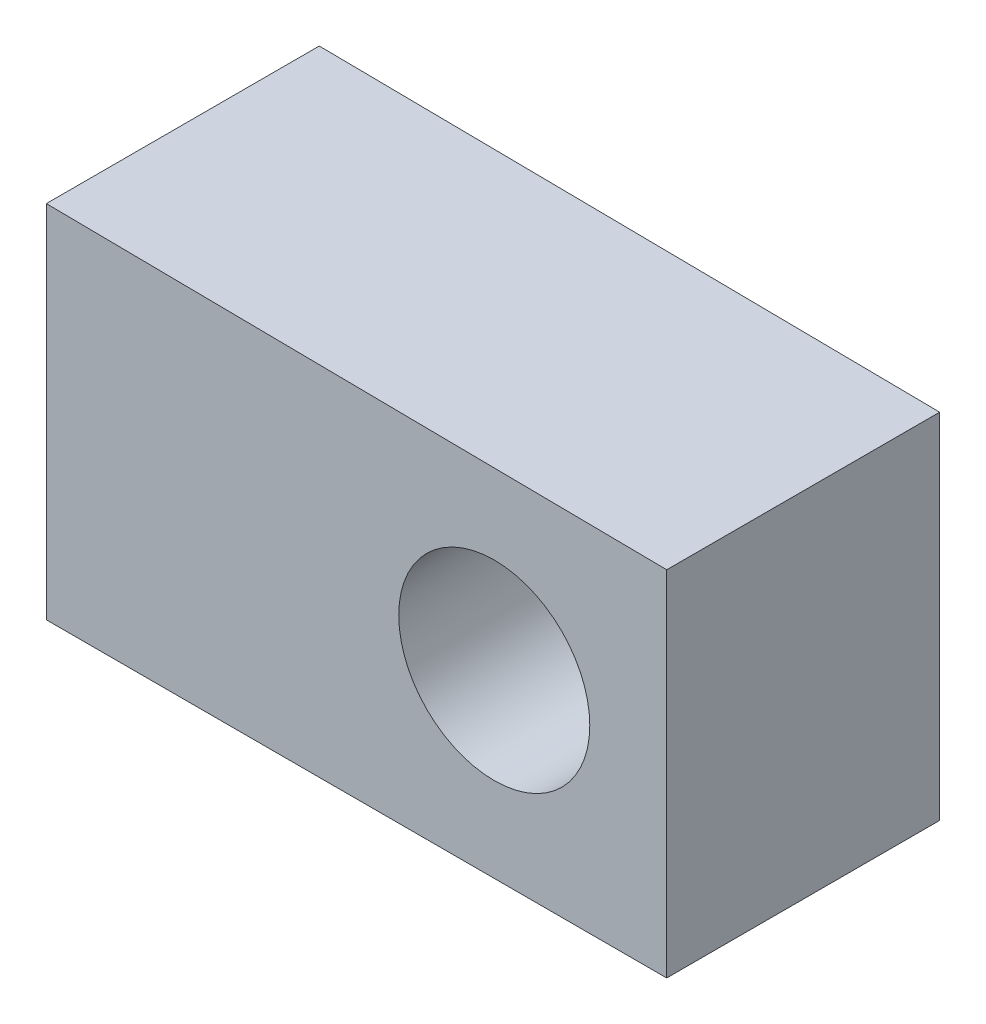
from build123d import *

# Parameters (mm, degrees)
ESQUISSE1_R        = 3.5
BOSS_EXTRU_1_DEPTH = 10


with BuildPart() as part:
    # Esquisse1 → Boss.-Extru.1 (new body)
    with BuildSketch(Plane.XY):
        Polygon((31541.595840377, 62891.495171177), (31541.595840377, 62878.541171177), (31518.865714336, 62878.541171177), (31518.865714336, 62891.749171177), align=None)
        with Locations((31535.277104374, 62885.145356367)):
            Circle(ESQUISSE1_R, mode=Mode.SUBTRACT)
    extrude(amount=BOSS_EXTRU_1_DEPTH)


solid = part.part
